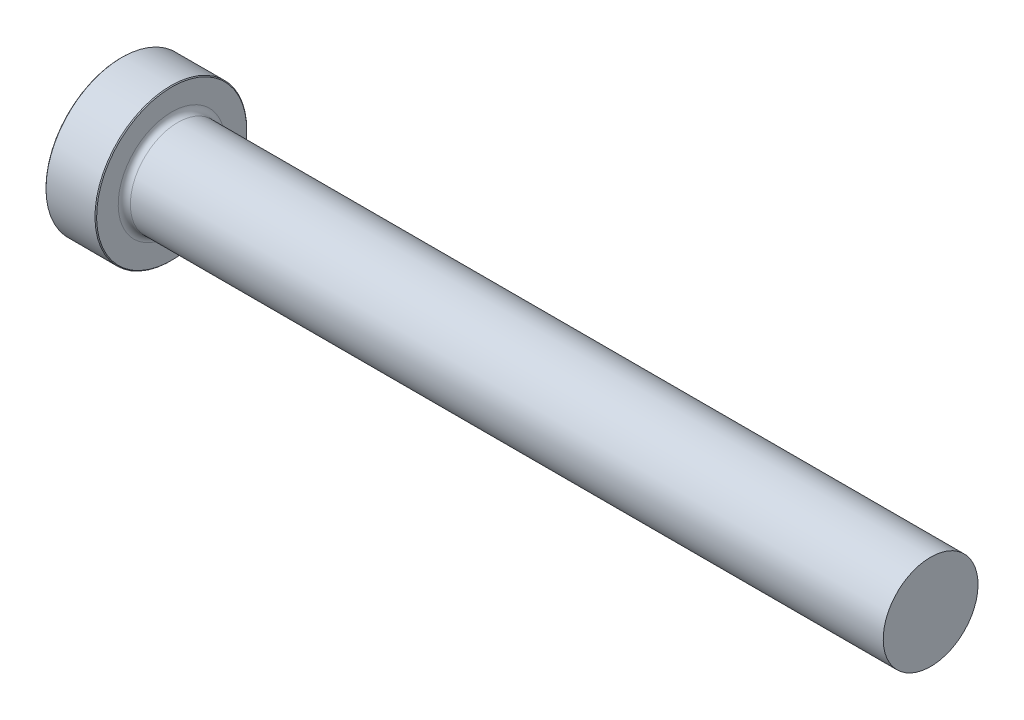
from build123d import *

# Parameters (mm, degrees)
CHAMFER1_SIZE = 0.1016


with BuildPart() as part:
    # Sketch1 → Revolve1 (revolve)
    with BuildSketch(Plane.XY):
        with BuildLine():
            Line((0, 0), (0, 9.525))
            Line((0, 9.525), (6.35, 9.525))
            Line((6.35, 9.525), (6.35, 6.711315))
            ThreePointArc((6.35, 6.711315), (6.573184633, 6.172499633), (7.112, 5.949315))
            Line((7.112, 5.949315), (101.6, 5.949315))
            Line((101.6, 5.949315), (101.6, 0))
            Line((101.6, 0), (0, 0))
        make_face()
    revolve(axis=Axis((101.6, 0, 0), (-1, 0, 0)))

    # Chamfer1
    chamfer1_edges = [part.edges().sort_by_distance(p)[0] for p in [
        (0, -9.525, 0),
        (6.35, -9.525, 0),
    ]]
    chamfer(chamfer1_edges, length=CHAMFER1_SIZE)


solid = part.part
